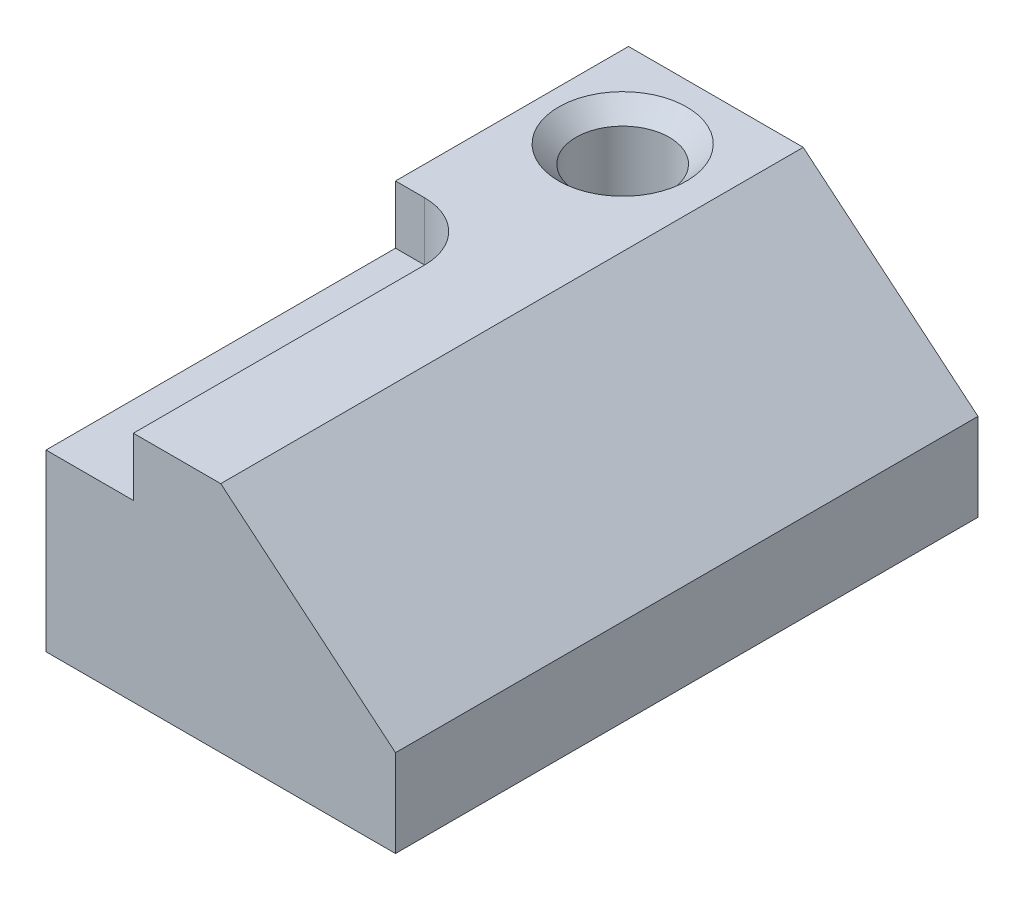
from build123d import *

# Parameters (mm, degrees)
EXTRUDE2_DEPTH     = 127
SKETCH6_R          = 10.16
CUT_EXTRUDE3_DEPTH = 157.576115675
CHAMFER2_SIZE      = 3.81
SKETCH7_W          = 19.05
SKETCH7_H          = 76.2
CUT_EXTRUDE4_DEPTH = 12.7
FILLET2_R          = 12.7


with BuildPart() as part:
    # Sketch5 → Extrude2 (new body)
    with BuildSketch(Plane.XY):
        Polygon((0, 0), (0, 50.8), (38.1, 50.8), (76.2, 19.05), (76.2, 0), align=None)
    extrude(amount=EXTRUDE2_DEPTH)

    # Sketch6 → Cut-Extrude3 (cut, through all)
    with BuildSketch(Plane(origin=(0, 50.8, 0), x_dir=(-1, 0, 0), z_dir=(0, 1, 0))):
        with Locations(Location((-17.78, 19.05, 0), (0, 0, 90))):
            Circle(SKETCH6_R)
    extrude(amount=-CUT_EXTRUDE3_DEPTH, mode=Mode.SUBTRACT)

    # Chamfer2
    chamfer2_edges = [part.edges().sort_by_distance(p)[0] for p in [
        (17.78, 50.8, 8.89),
    ]]
    chamfer(chamfer2_edges, length=CHAMFER2_SIZE)

    # Sketch7 → Cut-Extrude4 (cut)
    with BuildSketch(Plane(origin=(0, 50.8, 0), x_dir=(-1, 0, 0), z_dir=(0, 1, 0))):
        with Locations((-9.525, 88.9)):
            Rectangle(SKETCH7_W, SKETCH7_H)
    extrude(amount=-CUT_EXTRUDE4_DEPTH, mode=Mode.SUBTRACT)

    # Fillet2
    fillet2_edges = [part.edges().sort_by_distance(p)[0] for p in [
        (19.05, 44.45, 50.8),
    ]]
    fillet(fillet2_edges, radius=FILLET2_R)


solid = part.part
